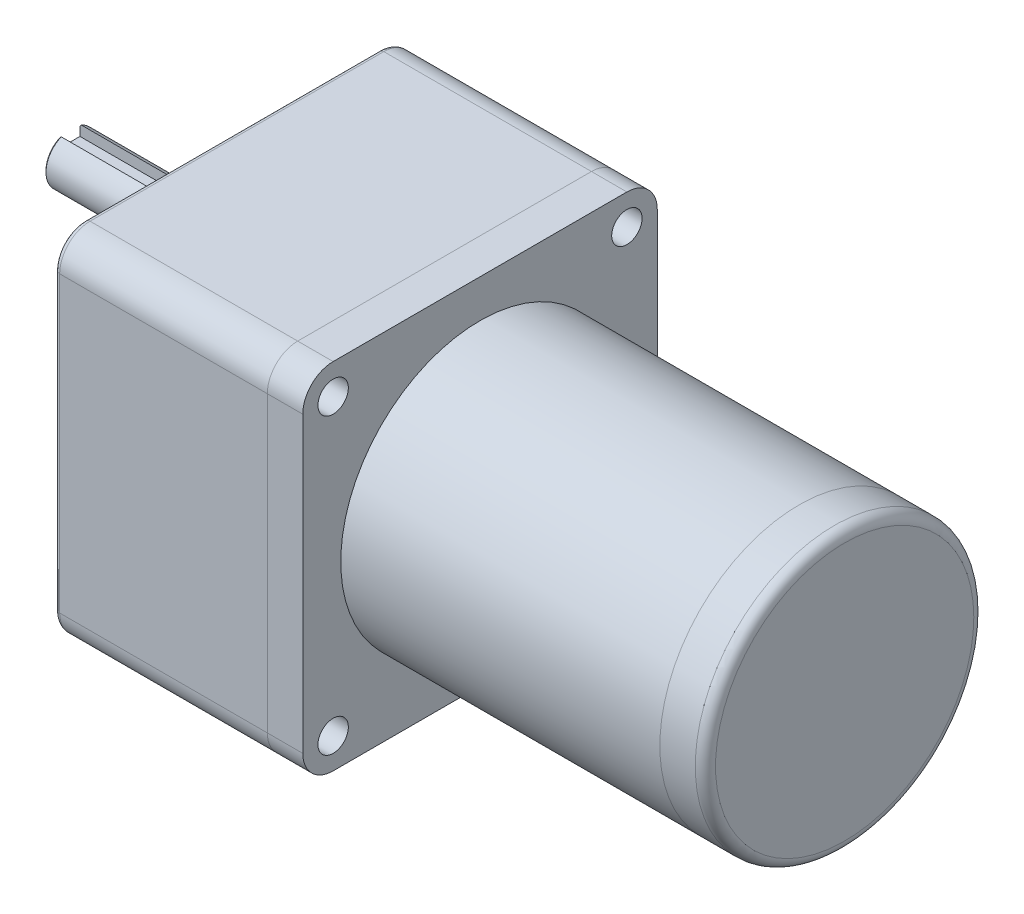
from build123d import *

# Parameters (mm, degrees)
EXTRUDE_1_DEPTH             = 42
EXTRUDE_2_DEPTH             = 7
FILLET_1_R                  = 1
SKETCH_3_R                  = 27.5
EXTRUDE_3_DEPTH             = 63
SKETCH_4_R                  = 27.5
EXTRUDE_4_DEPTH             = 9
FILLET_2_R                  = 2
HOLE_WIZARD_M5_1_AT_2_COUNT = 2
HOLE_WIZARD_M5_1_AT_2_PITCH = 57.982756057
HOLE_WIZARD_M5_1_AT_3_COUNT = 2
HOLE_WIZARD_M5_1_AT_3_PITCH = 82
HOLE_WIZARD_M5_1_AT_4_COUNT = 2
HOLE_WIZARD_M5_1_AT_4_PITCH = 57.982756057
SKETCH_7_R                  = 3
CUT_EXTRUDE_1_DEPTH         = 35
SKETCH_8_R                  = 12
EXTRUDE_5_DEPTH             = 3
SKETCH_9_R                  = 5
EXTRUDE_6_DEPTH             = 29
FILLET_3_R                  = 0.5
SKETCH_10_R                 = 30
CUT_EXTRUDE_2_DEPTH         = 0.5
CUT_EXTRUDE_3_DEPTH         = 2.5
CHAMFER_1_SIZE              = 0.3


with BuildPart() as part:
    # Sketch 1 → Extrude 1 (new body)
    with BuildSketch(Plane(origin=(0, 0, 0), x_dir=(0, 0, -1), z_dir=(1, 0, 0))):
        with BuildLine():
            Line((29, -35), (-29, -35))
            ThreePointArc((-29, -35), (-33.242640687, -33.242640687), (-35, -29))
            Line((-35, -29), (-35, 29))
            ThreePointArc((-35, 29), (-33.242640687, 33.242640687), (-29, 35))
            Line((-29, 35), (29, 35))
            ThreePointArc((29, 35), (33.242640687, 33.242640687), (35, 29))
            Line((35, 29), (35, -29))
            ThreePointArc((35, -29), (33.242640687, -33.242640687), (29, -35))
        make_face()
    extrude(amount=EXTRUDE_1_DEPTH)

    # Fillet 1
    fillet_1_edges = [part.edges().sort_by_distance(p)[0] for p in [
        (0, -35, 0),
        (0, -33.242640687, 33.242640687),
        (0, 0, 35),
        (0, 33.242640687, 33.242640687),
        (0, 35, 0),
        (0, 33.242640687, -33.242640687),
        (0, 0, -35),
        (0, -33.242640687, -33.242640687),
    ]]
    fillet(fillet_1_edges, radius=FILLET_1_R)

    # Sketch 6 → Hole Wizard M5 _1 (revolve, cut)
    with BuildSketch(Plane(origin=(0, 28.991378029, -28.991378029), x_dir=(0, 0, 1), z_dir=(0, 1, 0))):
        Polygon((0, 0), (0, 15.2618073), (2.1, 14), (2.1, 0), align=None)
    hole_wizard_m5_1 = revolve(axis=Axis((-6.35, 28.991378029, -28.991378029), (1, 0, 0)), mode=Mode.SUBTRACT)

    # Hole Wizard M5 _1 at 2: Hole Wizard M5 _1 ×2
    with Locations(*[(0, -i * HOLE_WIZARD_M5_1_AT_2_PITCH, 0) for i in range(1, HOLE_WIZARD_M5_1_AT_2_COUNT)]):
        add(hole_wizard_m5_1, mode=Mode.SUBTRACT)

    # Hole Wizard M5 _1 at 3: Hole Wizard M5 _1 ×2
    with Locations(*[Vector(0, -0.7071067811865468, 0.7071067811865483) * (i * HOLE_WIZARD_M5_1_AT_3_PITCH) for i in range(1, HOLE_WIZARD_M5_1_AT_3_COUNT)]):
        add(hole_wizard_m5_1, mode=Mode.SUBTRACT)

    # Hole Wizard M5 _1 at 4: Hole Wizard M5 _1 ×2
    with Locations(*[(0, 0, i * HOLE_WIZARD_M5_1_AT_4_PITCH) for i in range(1, HOLE_WIZARD_M5_1_AT_4_COUNT)]):
        add(hole_wizard_m5_1, mode=Mode.SUBTRACT)


with BuildPart() as body_2:
    # Sketch 2 → Extrude 2 (new body)
    with BuildSketch(Plane(origin=(42, 0, 0), x_dir=(0, 0, -1), z_dir=(1, 0, 0))):
        with BuildLine():
            Line((-29, -35), (29, -35))
            ThreePointArc((29, -35), (33.242640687, -33.242640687), (35, -29))
            Line((35, -29), (35, 29))
            ThreePointArc((35, 29), (33.242640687, 33.242640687), (29, 35))
            Line((29, 35), (-29, 35))
            ThreePointArc((-29, 35), (-33.242640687, 33.242640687), (-35, 29))
            Line((-35, 29), (-35, -29))
            ThreePointArc((-35, -29), (-33.242640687, -33.242640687), (-29, -35))
        make_face()
    extrude(amount=EXTRUDE_2_DEPTH)


with BuildPart() as body_3:
    # Sketch 3 → Extrude 3 (new body)
    with BuildSketch(Plane(origin=(49, 0, 0), x_dir=(0, 0, -1), z_dir=(1, 0, 0))):
        Circle(SKETCH_3_R)
    extrude(amount=EXTRUDE_3_DEPTH)


with BuildPart() as body_4:
    # Sketch 4 → Extrude 4 (new body)
    with BuildSketch(Plane(origin=(112, 0, 0), x_dir=(0, 0, -1), z_dir=(1, 0, 0))):
        Circle(SKETCH_4_R)
    extrude(amount=EXTRUDE_4_DEPTH)

    # Fillet 2
    fillet_2_edges = [body_4.edges().sort_by_distance(p)[0] for p in [
        (121, 0, 27.5),
    ]]
    fillet(fillet_2_edges, radius=FILLET_2_R)


with BuildPart() as cut_extrude_1_tool:
    # Sketch 7 → Cut-Extrude 1 (new body)
    with BuildSketch(Plane(origin=(49, 0, 0), x_dir=(0, 0, -1), z_dir=(1, 0, 0))):
        with Locations((-29, 29)):
            Circle(SKETCH_7_R)
        with Locations((29, 29)):
            Circle(SKETCH_7_R)
        with Locations((29, -29)):
            Circle(SKETCH_7_R)
        with Locations((-29, -29)):
            Circle(SKETCH_7_R)
    extrude(amount=-CUT_EXTRUDE_1_DEPTH)


with BuildPart() as part_1:
    add(part.part)

    # Cut-Extrude 1: cut by cut_extrude_1_tool
    add(cut_extrude_1_tool.part, mode=Mode.SUBTRACT)

    # Sketch 10 → Cut-Extrude 2 (cut)
    with BuildSketch(Plane.ZY):
        Circle(SKETCH_10_R)
    extrude(amount=-CUT_EXTRUDE_2_DEPTH, mode=Mode.SUBTRACT)


with BuildPart() as body_2_1:
    add(body_2.part)

    # Cut-Extrude 1: cut by cut_extrude_1_tool
    add(cut_extrude_1_tool.part, mode=Mode.SUBTRACT)


with BuildPart() as body_5:
    # Sketch 8 → Extrude 5 (new body)
    with BuildSketch(Plane.ZY):
        with Locations((0, 15)):
            Circle(SKETCH_8_R)
    extrude(amount=EXTRUDE_5_DEPTH)

    # Fillet 3
    fillet_3_edges = [body_5.edges().sort_by_distance(p)[0] for p in [
        (-3, 15, -12),
    ]]
    fillet(fillet_3_edges, radius=FILLET_3_R)


with BuildPart() as body_6:
    # Sketch 9 → Extrude 6 (new body)
    with BuildSketch(Plane.ZY.offset(3)):
        with Locations(Location((0, 15, 0), (0, 0, 180))):
            Circle(SKETCH_9_R)
    extrude(amount=EXTRUDE_6_DEPTH)

    # Sketch 11 → Cut-Extrude 3 (cut)
    with BuildSketch(Plane(origin=(0, 20, 0), x_dir=(1, 0, 0), z_dir=(0, 1, 0))):
        with BuildLine():
            Line((-9, 2), (-32, 2))
            Line((-32, 2), (-32, -2))
            Line((-32, -2), (-9, -2))
            ThreePointArc((-9, -2), (-7, 0), (-9, 2))
        make_face()
    extrude(amount=-CUT_EXTRUDE_3_DEPTH, mode=Mode.SUBTRACT)

    # Chamfer 1
    chamfer_1_edges = [body_6.edges().sort_by_distance(p)[0] for p in [
        (-32, 10.816699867, 2.738612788),
    ]]
    chamfer(chamfer_1_edges, length=CHAMFER_1_SIZE)


solid = Compound([body_3.part, body_4.part, part_1.part, body_2_1.part, body_5.part, body_6.part])
